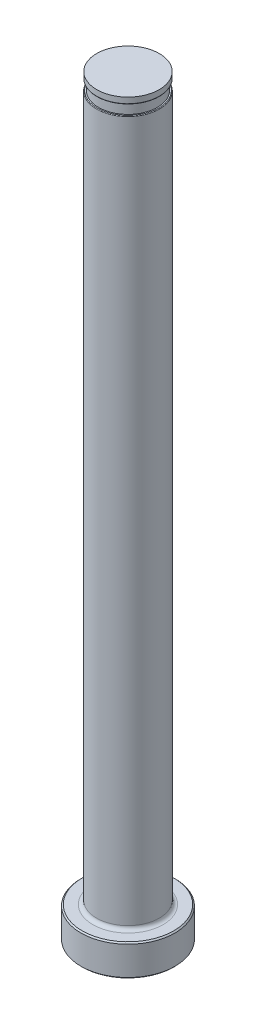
from build123d import *

# Parameters (mm, degrees)
CHAMFER1_SIZE     = 0.254
FILLET1_R         = 0.762
SKETCH2_W         = 0.381
SKETCH2_H         = 2.032
D_SLOT_DEPTH      = 153.9941543
D_SLOT_DEPTH_BACK = 153.9941543
SKETCH5_W         = 0.0127
SKETCH5_H         = 1.27
FILLET2_R         = 0.127


with BuildPart() as part:
    # Sketch1 → Revolve1 (revolve)
    with BuildSketch(Plane.XY, mode=Mode.PRIVATE) as revolve1_sk:
        Polygon((0, 0), (-9.525, 0), (-9.525, 6.35), (-6.35, 6.35), (-6.35, 152.4), (0, 152.4), align=None)
    revolve(revolve1_sk.sketch.rotate(Axis((0, 259.958771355, 0), (0, -1, 0)), 270), axis=Axis((0, 259.958771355, 0), (0, -1, 0)))

    # Chamfer1
    chamfer1_edges = [part.edges().sort_by_distance(p)[0] for p in [
        (0, 6.35, -9.525),
        (0, 0, -9.525),
    ]]
    chamfer(chamfer1_edges, length=CHAMFER1_SIZE)

    # Fillet1
    fillet1_edges = [part.edges().sort_by_distance(p)[0] for p in [
        (0, 6.35, -6.35),
    ]]
    fillet(fillet1_edges, radius=FILLET1_R)

    # Sketch2 → Vent Relief (revolve, cut)
    with BuildSketch(Plane.XY, mode=Mode.PRIVATE) as vent_relief_sk:
        with Locations((-6.1595, 150.114)):
            Rectangle(SKETCH2_W, SKETCH2_H)
    revolve(vent_relief_sk.sketch.rotate(Axis((0, 153.448281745, 0), (0, -1, 0)), 270), axis=Axis((0, 153.448281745, 0), (0, -1, 0)), mode=Mode.SUBTRACT)

    # Sketch3 → D-Slot (cut, two sides: drawn at the far end of the back side and taken through both)
    with BuildSketch(Plane.XY.offset(-D_SLOT_DEPTH_BACK)):
        with BuildLine():
            Line((-5.969, 150.114), (-5.969, 86.614))
            ThreePointArc((-5.969, 86.614), (-6.065723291, 85.836287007), (-6.35, 85.105958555))
            Line((-6.35, 85.105958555), (-6.35, 150.114))
            Line((-6.35, 150.114), (-5.969, 150.114))
        make_face()
    extrude(amount=D_SLOT_DEPTH + D_SLOT_DEPTH_BACK, mode=Mode.SUBTRACT)

    # Sketch5 → Vent Diameter (revolve, cut)
    with BuildSketch(Plane.XY, mode=Mode.PRIVATE) as vent_diameter_sk:
        with Locations((-6.34365, 151.765)):
            Rectangle(SKETCH5_W, SKETCH5_H)
    revolve(vent_diameter_sk.sketch.rotate(Axis((0, 152.687735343, 0), (0, -1, 0)), 90), axis=Axis((0, 152.687735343, 0), (0, -1, 0)), mode=Mode.SUBTRACT)

    # Fillet2
    fillet2_edges = [part.edges().sort_by_distance(p)[0] for p in [
        (5.199976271, 149.098, -3.644550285),
        (0, 151.13, 6.3373),
    ]]
    fillet(fillet2_edges, radius=FILLET2_R)


solid = part.part
